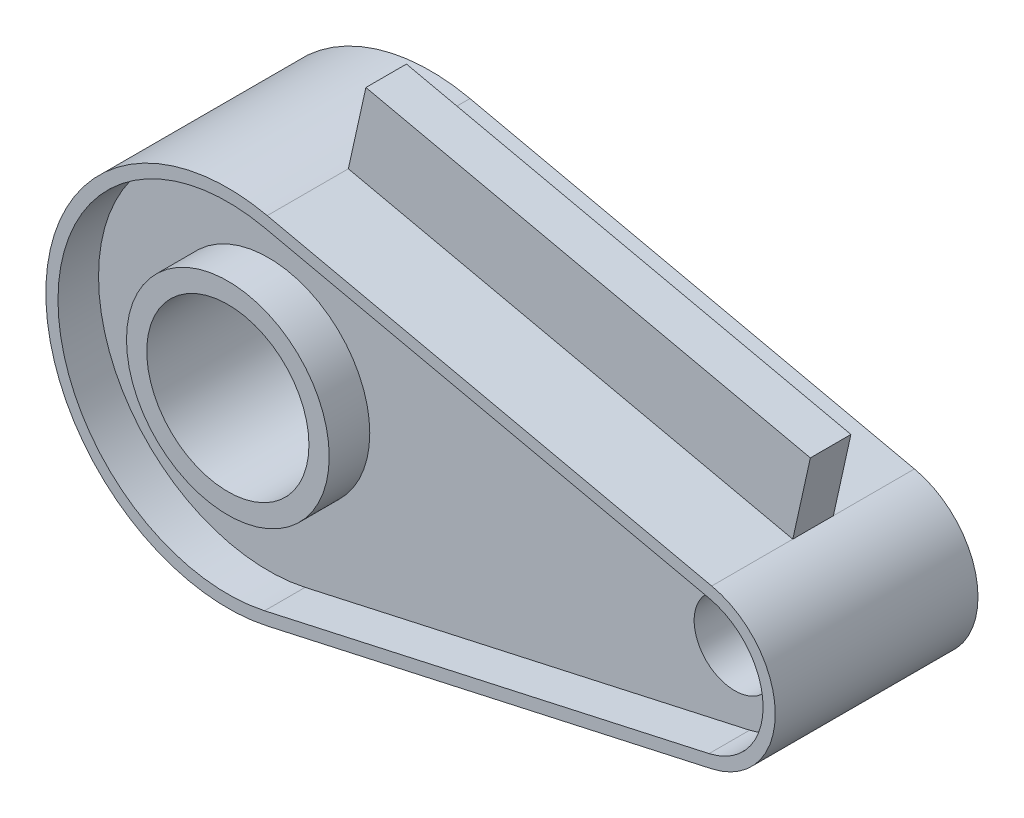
from build123d import *

# Parameters (mm, degrees)
SKETCH1_R           = 20
SKETCH1_R_2         = 10
EXTRUDE1_DEPTH      = 25
SKETCH3_R           = 25
CUT_EXTRUDE3_DEPTH  = 10
SKETCH4_W           = 112.274040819
SKETCH4_H           = 10
EXTRUDE_THIN1_DEPTH = 20


with BuildPart() as part:
    # Sketch1 → Extrude1 (new, symmetric)
    with BuildSketch(Plane.XY):
        with BuildLine():
            Line((4.328792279, -19.525920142), (-105.283905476, -43.826470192))
            ThreePointArc((-105.283905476, -43.826470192), (-159.890555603, 0), (-105.283905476, 43.826470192))
            Line((-105.283905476, 43.826470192), (4.328792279, 19.525920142))
            ThreePointArc((4.328792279, 19.525920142), (20, 0), (4.328792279, -19.525920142))
        make_face()
        with Locations((-115, 0)):
            Circle(SKETCH1_R, mode=Mode.SUBTRACT)
        Circle(SKETCH1_R_2, mode=Mode.SUBTRACT)
    extrude(amount=EXTRUDE1_DEPTH, both=True)

    # Sketch3 → Cut-Extrude3 (cut)
    with BuildSketch(Plane.XY.offset(25)):
        with BuildLine():
            Line((3.679473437, 16.597032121), (-105.933224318, 40.897582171))
            ThreePointArc((-105.933224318, 40.897582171), (-156.890555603, 0), (-105.933224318, -40.897582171))
            Line((-105.933224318, -40.897582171), (3.679473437, -16.597032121))
            ThreePointArc((3.679473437, -16.597032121), (17, 0), (3.679473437, 16.597032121))
        make_face()
        with Locations((-115, 0)):
            Circle(SKETCH3_R, mode=Mode.SUBTRACT)
    extrude(amount=-CUT_EXTRUDE3_DEPTH, mode=Mode.SUBTRACT)

    # Sketch4 → Extrude-Thin1 (add)
    with BuildSketch(Plane(origin=(4.328792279, 19.525920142, 0), x_dir=(-0.976296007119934, 0.21643961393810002, 0), z_dir=(0.21643961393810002, 0.9762960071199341, 0))):
        with Locations((56.13702041, 0)):
            Rectangle(SKETCH4_W, SKETCH4_H)
    extrude(amount=EXTRUDE_THIN1_DEPTH)


solid = part.part
